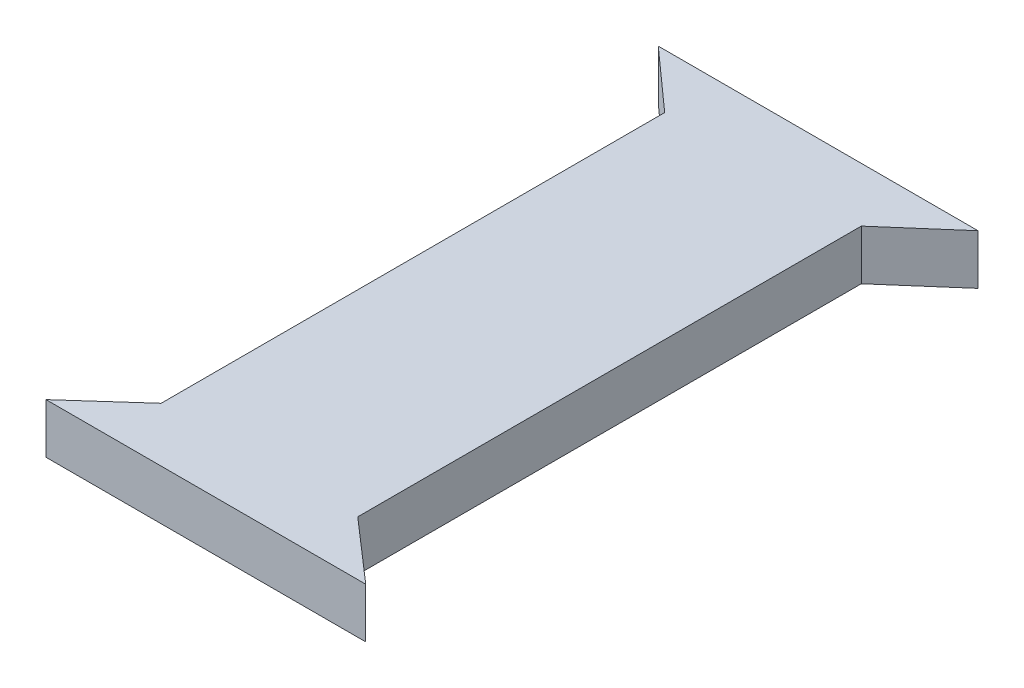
from build123d import *

# Parameters (mm, degrees)
BOSS_EXTRUDE1_DEPTH = 12.5


with BuildPart() as part:
    # Sketch1 → Boss-Extrude1 (new body)
    with BuildSketch(Plane(origin=(0, 0, 0), x_dir=(1, 0, 0), z_dir=(0, 1, 0))):
        Polygon((-24.6, 63), (-39.8, 76.6), (40.2, 76.6), (24.6, 63), (24.6, -63), (40.2, -76.6), (-39.8, -76.6), (-24.6, -63), align=None)
    extrude(amount=BOSS_EXTRUDE1_DEPTH)


solid = part.part
